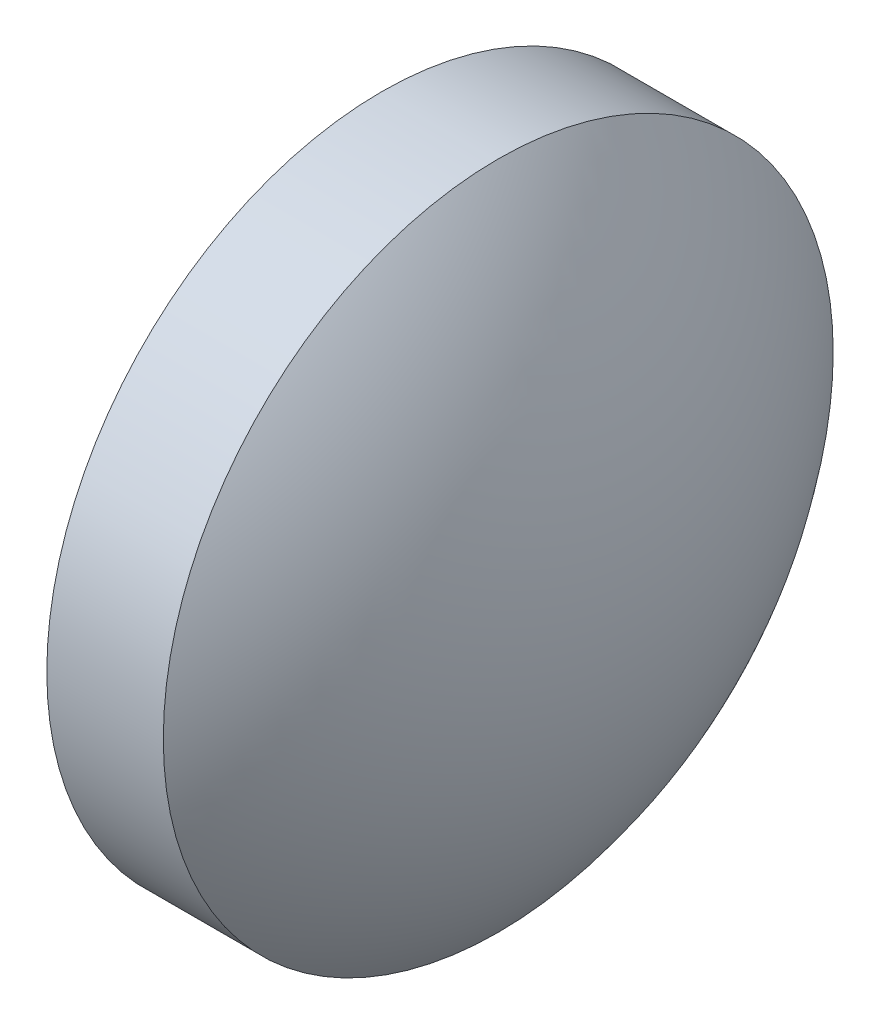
from build123d import *


with BuildPart() as part:
    # Skizze1 → Rotation1 (revolve)
    with BuildSketch(Plane.XY):
        with BuildLine():
            Line((15, 0), (17.5, 0))
            ThreePointArc((17.5, 0), (17.223547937, 1.593139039), (16.426515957, 3))
            Line((16.426515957, 3), (15.383028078, 3))
            ThreePointArc((15.383028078, 3), (15.096144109, 1.512176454), (15, 0))
        make_face()
    revolve(axis=Axis((15, 0, 0), (1, 0, 0)))


solid = part.part
